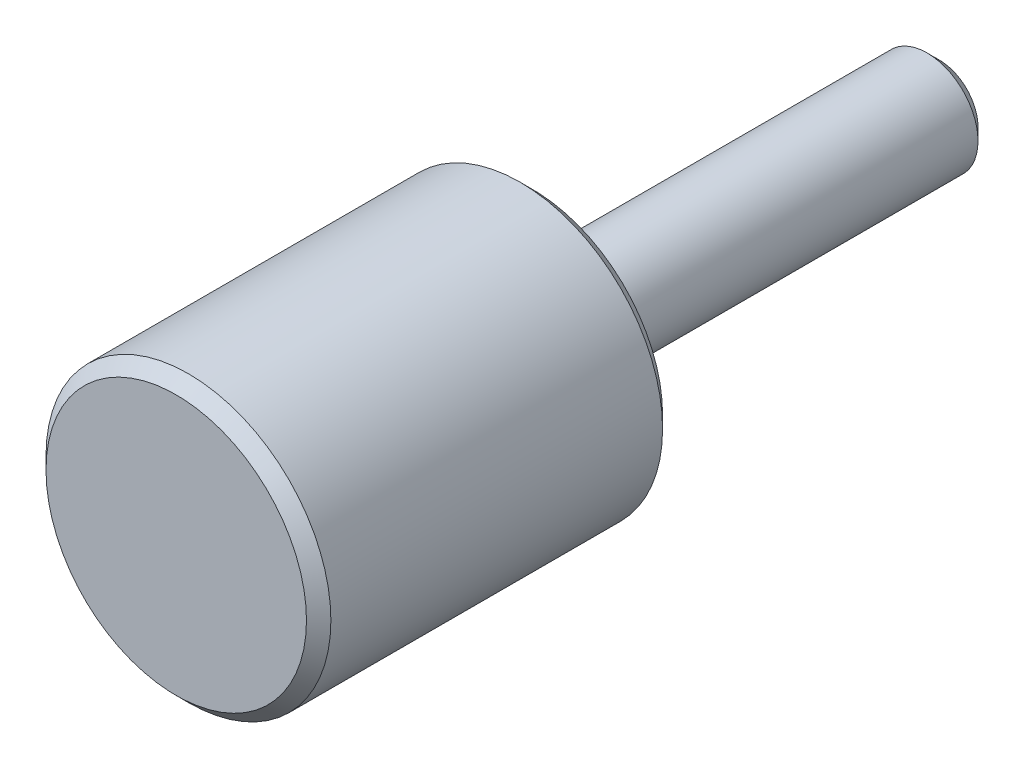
ISO-10303-21;
HEADER;
FILE_DESCRIPTION(('STEP AP214'),'2;1');
FILE_NAME('part.step','',(''),(''),'','','');
FILE_SCHEMA(('AUTOMOTIVE_DESIGN { 1 0 10303 214 1 1 1 1 }'));
ENDSEC;
DATA;
#1=APPLICATION_CONTEXT('core data for automotive mechanical design processes');
#2=APPLICATION_PROTOCOL_DEFINITION('international standard','automotive_design',2000,#1);
#3=PRODUCT_CONTEXT('',#1,'mechanical');
#4=PRODUCT('Part','Part','',(#3));
#5=PRODUCT_RELATED_PRODUCT_CATEGORY('part','',(#4));
#6=PRODUCT_DEFINITION_FORMATION('','',#4);
#7=PRODUCT_DEFINITION_CONTEXT('part definition',#1,'design');
#8=PRODUCT_DEFINITION('design','',#6,#7);
#9=PRODUCT_DEFINITION_SHAPE('','',#8);
#10=(LENGTH_UNIT() NAMED_UNIT(*) SI_UNIT(.MILLI.,.METRE.));
#11=(NAMED_UNIT(*) PLANE_ANGLE_UNIT() SI_UNIT($,.RADIAN.));
#12=(NAMED_UNIT(*) SI_UNIT($,.STERADIAN.) SOLID_ANGLE_UNIT());
#13=UNCERTAINTY_MEASURE_WITH_UNIT(LENGTH_MEASURE(1.E-05),#10,'distance_accuracy_value','');
#14=(GEOMETRIC_REPRESENTATION_CONTEXT(3) GLOBAL_UNCERTAINTY_ASSIGNED_CONTEXT((#13)) GLOBAL_UNIT_ASSIGNED_CONTEXT((#10,
#11,#12)) REPRESENTATION_CONTEXT('',''));
#15=CARTESIAN_POINT('',(0.,0.,0.));
#16=DIRECTION('',(0.,0.,1.));
#17=DIRECTION('',(1.,0.,0.));
#18=AXIS2_PLACEMENT_3D('',#15,#16,#17);
#19=CARTESIAN_POINT('',(0.,0.,35.));
#20=DIRECTION('',(0.,0.,-1.));
#21=DIRECTION('',(-1.,0.,0.));
#22=AXIS2_PLACEMENT_3D('',#19,#20,#21);
#23=CYLINDRICAL_SURFACE('',#22,14.);
#24=CARTESIAN_POINT('',(0.,0.,33.8));
#25=DIRECTION('',(0.,0.,1.));
#26=DIRECTION('',(1.,0.,0.));
#27=AXIS2_PLACEMENT_3D('',#24,#25,#26);
#28=CIRCLE('',#27,14.);
#29=CARTESIAN_POINT('',(14.,0.,33.8));
#30=VERTEX_POINT('',#29);
#31=EDGE_CURVE('E24',#30,#30,#28,.F.);
#32=ORIENTED_EDGE('',*,*,#31,.T.);
#33=EDGE_LOOP('',(#32));
#34=FACE_BOUND('',#33,.T.);
#35=CARTESIAN_POINT('',(0.,0.,1.2));
#36=DIRECTION('',(0.,0.,1.));
#37=DIRECTION('',(1.,0.,0.));
#38=AXIS2_PLACEMENT_3D('',#35,#36,#37);
#39=CIRCLE('',#38,14.);
#40=CARTESIAN_POINT('',(14.,0.,1.2));
#41=VERTEX_POINT('',#40);
#42=EDGE_CURVE('E35',#41,#41,#39,.T.);
#43=ORIENTED_EDGE('',*,*,#42,.T.);
#44=EDGE_LOOP('',(#43));
#45=FACE_BOUND('',#44,.T.);
#46=ADVANCED_FACE('F12',(#34,#45),#23,.T.);
#47=CARTESIAN_POINT('',(0.,0.,35.));
#48=DIRECTION('',(0.,0.,1.));
#49=DIRECTION('',(1.,0.,0.));
#50=AXIS2_PLACEMENT_3D('',#47,#48,#49);
#51=PLANE('',#50);
#52=CARTESIAN_POINT('',(0.,0.,35.));
#53=DIRECTION('',(0.,0.,1.));
#54=DIRECTION('',(1.,0.,0.));
#55=AXIS2_PLACEMENT_3D('',#52,#53,#54);
#56=CIRCLE('',#55,12.8);
#57=CARTESIAN_POINT('',(12.8,0.,35.));
#58=VERTEX_POINT('',#57);
#59=EDGE_CURVE('E29',#58,#58,#56,.T.);
#60=ORIENTED_EDGE('',*,*,#59,.T.);
#61=EDGE_LOOP('',(#60));
#62=FACE_BOUND('',#61,.T.);
#63=ADVANCED_FACE('F47',(#62),#51,.T.);
#64=CARTESIAN_POINT('',(0.,0.,0.));
#65=DIRECTION('',(0.,0.,1.));
#66=DIRECTION('',(1.,0.,0.));
#67=AXIS2_PLACEMENT_3D('',#64,#65,#66);
#68=PLANE('',#67);
#69=CARTESIAN_POINT('',(0.,0.,0.));
#70=DIRECTION('',(0.,0.,1.));
#71=DIRECTION('',(1.,0.,0.));
#72=AXIS2_PLACEMENT_3D('',#69,#70,#71);
#73=CIRCLE('',#72,12.8);
#74=CARTESIAN_POINT('',(12.8,0.,0.));
#75=VERTEX_POINT('',#74);
#76=EDGE_CURVE('E32',#75,#75,#73,.F.);
#77=ORIENTED_EDGE('',*,*,#76,.T.);
#78=EDGE_LOOP('',(#77));
#79=FACE_BOUND('',#78,.T.);
#80=CARTESIAN_POINT('',(0.,0.,0.));
#81=DIRECTION('',(0.,0.,-1.));
#82=DIRECTION('',(-1.,0.,0.));
#83=AXIS2_PLACEMENT_3D('',#80,#81,#82);
#84=CIRCLE('',#83,5.);
#85=CARTESIAN_POINT('',(-5.,0.,0.));
#86=VERTEX_POINT('',#85);
#87=EDGE_CURVE('E16',#86,#86,#84,.T.);
#88=ORIENTED_EDGE('',*,*,#87,.F.);
#89=EDGE_LOOP('',(#88));
#90=FACE_BOUND('',#89,.T.);
#91=ADVANCED_FACE('F44',(#79,#90),#68,.F.);
#92=CARTESIAN_POINT('',(0.,0.,1.2));
#93=DIRECTION('',(0.,0.,1.));
#94=DIRECTION('',(1.,0.,0.));
#95=AXIS2_PLACEMENT_3D('',#92,#93,#94);
#96=CONICAL_SURFACE('',#95,14.,0.785398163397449);
#97=ORIENTED_EDGE('',*,*,#76,.F.);
#98=EDGE_LOOP('',(#97));
#99=FACE_BOUND('',#98,.T.);
#100=ORIENTED_EDGE('',*,*,#42,.F.);
#101=EDGE_LOOP('',(#100));
#102=FACE_BOUND('',#101,.T.);
#103=ADVANCED_FACE('F46',(#99,#102),#96,.T.);
#104=CARTESIAN_POINT('',(0.,0.,35.));
#105=DIRECTION('',(0.,0.,-1.));
#106=DIRECTION('',(-1.,0.,0.));
#107=AXIS2_PLACEMENT_3D('',#104,#105,#106);
#108=CONICAL_SURFACE('',#107,12.8,0.785398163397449);
#109=ORIENTED_EDGE('',*,*,#31,.F.);
#110=EDGE_LOOP('',(#109));
#111=FACE_BOUND('',#110,.T.);
#112=ORIENTED_EDGE('',*,*,#59,.F.);
#113=EDGE_LOOP('',(#112));
#114=FACE_BOUND('',#113,.T.);
#115=ADVANCED_FACE('F55',(#111,#114),#108,.T.);
#116=CARTESIAN_POINT('',(0.,0.,-40.));
#117=DIRECTION('',(0.,0.,1.));
#118=DIRECTION('',(1.,0.,0.));
#119=AXIS2_PLACEMENT_3D('',#116,#117,#118);
#120=PLANE('',#119);
#121=CARTESIAN_POINT('',(0.,0.,-40.));
#122=DIRECTION('',(0.,0.,1.));
#123=DIRECTION('',(1.,0.,0.));
#124=AXIS2_PLACEMENT_3D('',#121,#122,#123);
#125=CIRCLE('',#124,3.8);
#126=CARTESIAN_POINT('',(3.8,0.,-40.));
#127=VERTEX_POINT('',#126);
#128=EDGE_CURVE('E8',#127,#127,#125,.F.);
#129=ORIENTED_EDGE('',*,*,#128,.T.);
#130=EDGE_LOOP('',(#129));
#131=FACE_BOUND('',#130,.T.);
#132=ADVANCED_FACE('F68',(#131),#120,.F.);
#133=CARTESIAN_POINT('',(0.,0.,-38.8));
#134=DIRECTION('',(0.,0.,1.));
#135=DIRECTION('',(1.,0.,0.));
#136=AXIS2_PLACEMENT_3D('',#133,#134,#135);
#137=CONICAL_SURFACE('',#136,5.,0.785398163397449);
#138=ORIENTED_EDGE('',*,*,#128,.F.);
#139=EDGE_LOOP('',(#138));
#140=FACE_BOUND('',#139,.T.);
#141=CARTESIAN_POINT('',(0.,0.,-38.8));
#142=DIRECTION('',(0.,0.,1.));
#143=DIRECTION('',(1.,0.,0.));
#144=AXIS2_PLACEMENT_3D('',#141,#142,#143);
#145=CIRCLE('',#144,5.);
#146=CARTESIAN_POINT('',(5.,0.,-38.8));
#147=VERTEX_POINT('',#146);
#148=EDGE_CURVE('E20',#147,#147,#145,.T.);
#149=ORIENTED_EDGE('',*,*,#148,.F.);
#150=EDGE_LOOP('',(#149));
#151=FACE_BOUND('',#150,.T.);
#152=ADVANCED_FACE('F66',(#140,#151),#137,.T.);
#153=CARTESIAN_POINT('',(0.,0.,15.));
#154=DIRECTION('',(0.,0.,-1.));
#155=DIRECTION('',(-1.,0.,0.));
#156=AXIS2_PLACEMENT_3D('',#153,#154,#155);
#157=CYLINDRICAL_SURFACE('',#156,5.);
#158=ORIENTED_EDGE('',*,*,#87,.T.);
#159=EDGE_LOOP('',(#158));
#160=FACE_BOUND('',#159,.T.);
#161=ORIENTED_EDGE('',*,*,#148,.T.);
#162=EDGE_LOOP('',(#161));
#163=FACE_BOUND('',#162,.T.);
#164=ADVANCED_FACE('F14',(#160,#163),#157,.T.);
#165=CLOSED_SHELL('',(#46,#63,#91,#103,#115,#132,#152,#164));
#166=MANIFOLD_SOLID_BREP('B1',#165);
#167=ADVANCED_BREP_SHAPE_REPRESENTATION('',(#18,#166),#14);
#168=SHAPE_DEFINITION_REPRESENTATION(#9,#167);
ENDSEC;
END-ISO-10303-21;
